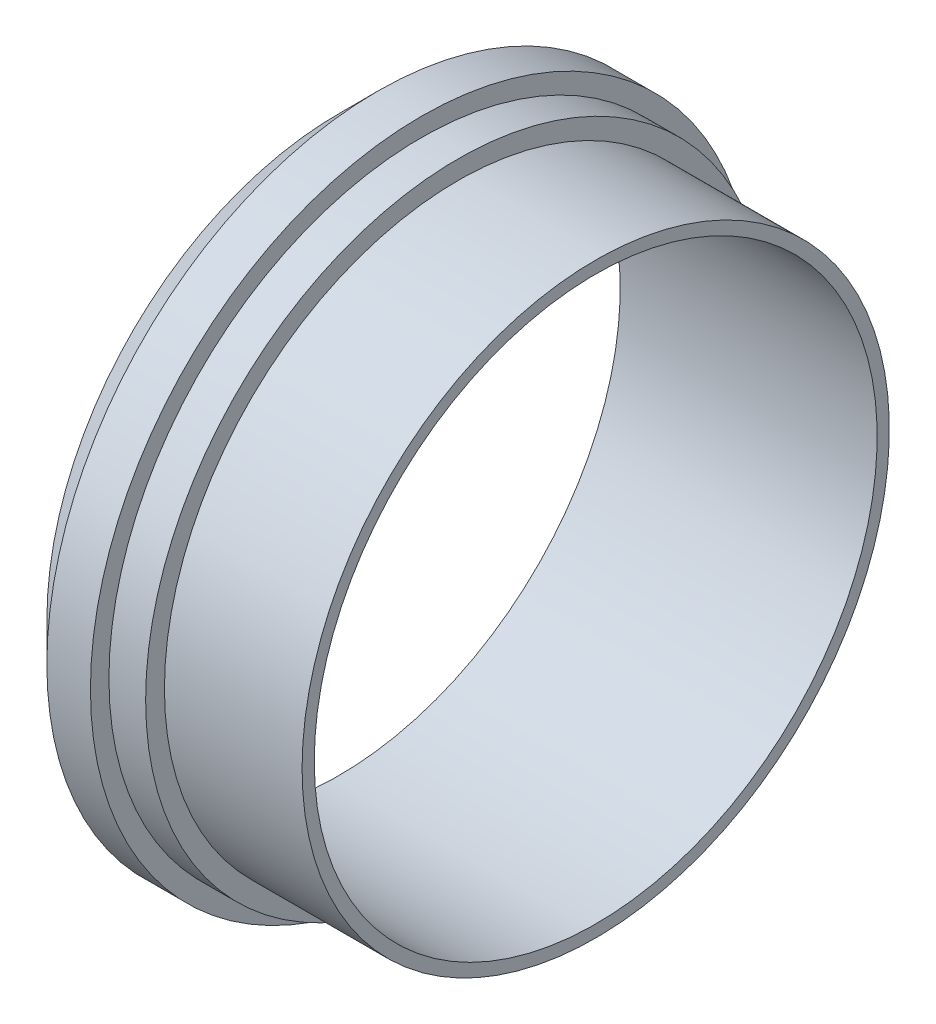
from build123d import *

# Parameters (mm, degrees)
SKETCH4_R          = 48.6918
CUT_EXTRUDE1_DEPTH = 44.45


with BuildPart() as part:
    # Sketch1 → Revolve1 (revolve)
    with BuildSketch(Plane.XY, mode=Mode.PRIVATE) as revolve1_sk:
        Polygon((0, 0), (-23.8125, 0), (-23.8125, -3.2512), (-30.1625, -3.2512), (-30.1625, -6.4516), (-37.70376, -6.4516), (-44.45, 0.3048), (-44.45, 50.8), (0, 50.8), align=None)
    revolve(revolve1_sk.sketch.rotate(Axis((-44.45, 50.8, 0), (1, 0, 0)), 270), axis=Axis((-44.45, 50.8, 0), (1, 0, 0)))

    # Sketch4 → Cut-Extrude1 (cut)
    with BuildSketch(Plane.ZY.offset(44.45)):
        with Locations((0, 50.8)):
            Circle(SKETCH4_R)
    extrude(amount=-CUT_EXTRUDE1_DEPTH, mode=Mode.SUBTRACT)


solid = part.part
